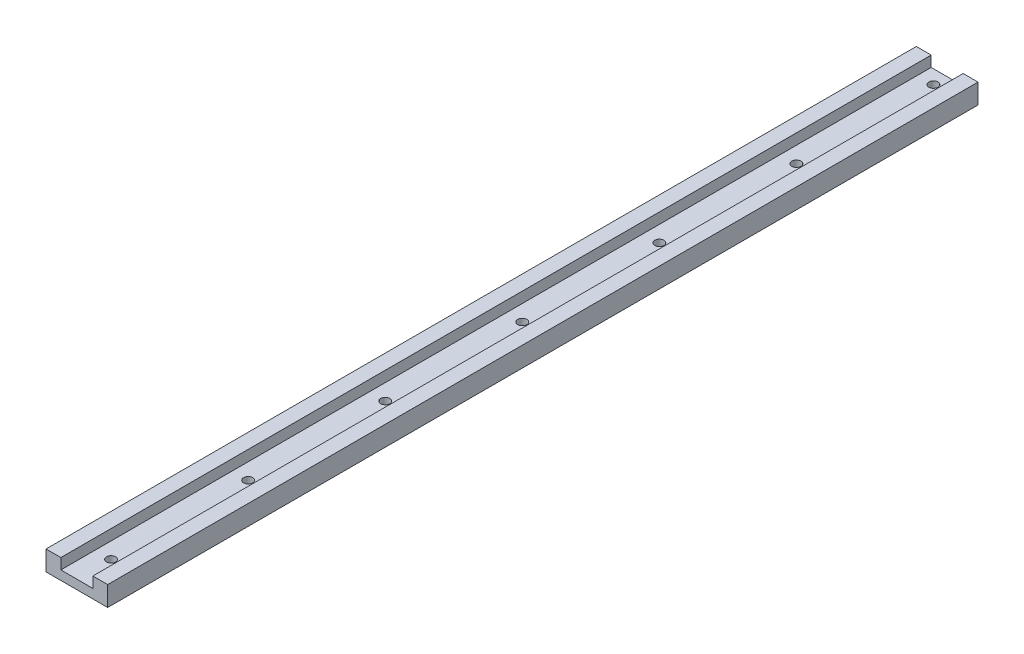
ISO-10303-21;
HEADER;
FILE_DESCRIPTION(('STEP AP214'),'2;1');
FILE_NAME('part.step','',(''),(''),'','','');
FILE_SCHEMA(('AUTOMOTIVE_DESIGN { 1 0 10303 214 1 1 1 1 }'));
ENDSEC;
DATA;
#1=APPLICATION_CONTEXT('core data for automotive mechanical design processes');
#2=APPLICATION_PROTOCOL_DEFINITION('international standard','automotive_design',2000,#1);
#3=PRODUCT_CONTEXT('',#1,'mechanical');
#4=PRODUCT('Part','Part','',(#3));
#5=PRODUCT_RELATED_PRODUCT_CATEGORY('part','',(#4));
#6=PRODUCT_DEFINITION_FORMATION('','',#4);
#7=PRODUCT_DEFINITION_CONTEXT('part definition',#1,'design');
#8=PRODUCT_DEFINITION('design','',#6,#7);
#9=PRODUCT_DEFINITION_SHAPE('','',#8);
#10=(LENGTH_UNIT() NAMED_UNIT(*) SI_UNIT(.MILLI.,.METRE.));
#11=(NAMED_UNIT(*) PLANE_ANGLE_UNIT() SI_UNIT($,.RADIAN.));
#12=(NAMED_UNIT(*) SI_UNIT($,.STERADIAN.) SOLID_ANGLE_UNIT());
#13=UNCERTAINTY_MEASURE_WITH_UNIT(LENGTH_MEASURE(1.E-05),#10,'distance_accuracy_value','');
#14=(GEOMETRIC_REPRESENTATION_CONTEXT(3) GLOBAL_UNCERTAINTY_ASSIGNED_CONTEXT((#13)) GLOBAL_UNIT_ASSIGNED_CONTEXT((#10,
#11,#12)) REPRESENTATION_CONTEXT('',''));
#15=CARTESIAN_POINT('',(0.,0.,0.));
#16=DIRECTION('',(0.,0.,1.));
#17=DIRECTION('',(1.,0.,0.));
#18=AXIS2_PLACEMENT_3D('',#15,#16,#17);
#19=CARTESIAN_POINT('',(13.5,-4.35,381.));
#20=DIRECTION('',(-1.,0.,0.));
#21=DIRECTION('',(0.,-1.,0.));
#22=AXIS2_PLACEMENT_3D('',#19,#20,#21);
#23=PLANE('',#22);
#24=DIRECTION('',(0.,1.,0.));
#25=VECTOR('',#24,1.);
#26=CARTESIAN_POINT('',(13.5,-4.35,0.));
#27=LINE('',#26,#25);
#28=CARTESIAN_POINT('',(13.5,-4.35,0.));
#29=VERTEX_POINT('',#28);
#30=CARTESIAN_POINT('',(13.5,4.35,0.));
#31=VERTEX_POINT('',#30);
#32=EDGE_CURVE('E132',#29,#31,#27,.T.);
#33=ORIENTED_EDGE('',*,*,#32,.T.);
#34=DIRECTION('',(0.,0.,-1.));
#35=VECTOR('',#34,1.);
#36=CARTESIAN_POINT('',(13.5,4.35,381.));
#37=LINE('',#36,#35);
#38=CARTESIAN_POINT('',(13.5,4.35,381.));
#39=VERTEX_POINT('',#38);
#40=EDGE_CURVE('E11',#39,#31,#37,.T.);
#41=ORIENTED_EDGE('',*,*,#40,.F.);
#42=DIRECTION('',(0.,1.,0.));
#43=VECTOR('',#42,1.);
#44=CARTESIAN_POINT('',(13.5,-4.35,381.));
#45=LINE('',#44,#43);
#46=CARTESIAN_POINT('',(13.5,-4.35,381.));
#47=VERTEX_POINT('',#46);
#48=EDGE_CURVE('E147',#47,#39,#45,.T.);
#49=ORIENTED_EDGE('',*,*,#48,.F.);
#50=DIRECTION('',(0.,0.,-1.));
#51=VECTOR('',#50,1.);
#52=CARTESIAN_POINT('',(13.5,-4.35,381.));
#53=LINE('',#52,#51);
#54=EDGE_CURVE('E128',#47,#29,#53,.T.);
#55=ORIENTED_EDGE('',*,*,#54,.T.);
#56=EDGE_LOOP('',(#33,#41,#49,#55));
#57=FACE_BOUND('',#56,.T.);
#58=ADVANCED_FACE('F35',(#57),#23,.F.);
#59=CARTESIAN_POINT('',(7.,4.35,381.));
#60=DIRECTION('',(0.,-1.,0.));
#61=DIRECTION('',(1.,0.,0.));
#62=AXIS2_PLACEMENT_3D('',#59,#60,#61);
#63=PLANE('',#62);
#64=DIRECTION('',(-1.,0.,0.));
#65=VECTOR('',#64,1.);
#66=CARTESIAN_POINT('',(7.,4.35,0.));
#67=LINE('',#66,#65);
#68=CARTESIAN_POINT('',(7.,4.35,0.));
#69=VERTEX_POINT('',#68);
#70=EDGE_CURVE('E135',#31,#69,#67,.T.);
#71=ORIENTED_EDGE('',*,*,#70,.T.);
#72=DIRECTION('',(0.,0.,-1.));
#73=VECTOR('',#72,1.);
#74=CARTESIAN_POINT('',(7.,4.35,381.));
#75=LINE('',#74,#73);
#76=CARTESIAN_POINT('',(7.,4.35,381.));
#77=VERTEX_POINT('',#76);
#78=EDGE_CURVE('E44',#77,#69,#75,.T.);
#79=ORIENTED_EDGE('',*,*,#78,.F.);
#80=DIRECTION('',(-1.,0.,0.));
#81=VECTOR('',#80,1.);
#82=CARTESIAN_POINT('',(7.,4.35,381.));
#83=LINE('',#82,#81);
#84=EDGE_CURVE('E95',#39,#77,#83,.T.);
#85=ORIENTED_EDGE('',*,*,#84,.F.);
#86=ORIENTED_EDGE('',*,*,#40,.T.);
#87=EDGE_LOOP('',(#71,#79,#85,#86));
#88=FACE_BOUND('',#87,.T.);
#89=ADVANCED_FACE('F270',(#88),#63,.F.);
#90=CARTESIAN_POINT('',(7.,4.35,381.));
#91=DIRECTION('',(1.,0.,0.));
#92=DIRECTION('',(0.,1.,0.));
#93=AXIS2_PLACEMENT_3D('',#90,#91,#92);
#94=PLANE('',#93);
#95=DIRECTION('',(0.,-1.,0.));
#96=VECTOR('',#95,1.);
#97=CARTESIAN_POINT('',(7.,4.35,0.));
#98=LINE('',#97,#96);
#99=CARTESIAN_POINT('',(7.,-0.349999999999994,0.));
#100=VERTEX_POINT('',#99);
#101=EDGE_CURVE('E138',#69,#100,#98,.T.);
#102=ORIENTED_EDGE('',*,*,#101,.T.);
#103=DIRECTION('',(0.,0.,-1.));
#104=VECTOR('',#103,1.);
#105=CARTESIAN_POINT('',(7.,-0.349999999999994,381.));
#106=LINE('',#105,#104);
#107=CARTESIAN_POINT('',(7.,-0.349999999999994,381.));
#108=VERTEX_POINT('',#107);
#109=EDGE_CURVE('E157',#108,#100,#106,.T.);
#110=ORIENTED_EDGE('',*,*,#109,.F.);
#111=DIRECTION('',(0.,-1.,0.));
#112=VECTOR('',#111,1.);
#113=CARTESIAN_POINT('',(7.,4.35,381.));
#114=LINE('',#113,#112);
#115=EDGE_CURVE('E167',#77,#108,#114,.T.);
#116=ORIENTED_EDGE('',*,*,#115,.F.);
#117=ORIENTED_EDGE('',*,*,#78,.T.);
#118=EDGE_LOOP('',(#102,#110,#116,#117));
#119=FACE_BOUND('',#118,.T.);
#120=ADVANCED_FACE('F165',(#119),#94,.F.);
#121=CARTESIAN_POINT('',(-7.,-0.349999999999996,381.));
#122=DIRECTION('',(0.,-1.,0.));
#123=DIRECTION('',(1.,0.,0.));
#124=AXIS2_PLACEMENT_3D('',#121,#122,#123);
#125=PLANE('',#124);
#126=CARTESIAN_POINT('',(0.,-0.349999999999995,6.00000000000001));
#127=DIRECTION('',(0.,1.,0.));
#128=DIRECTION('',(-1.,0.,0.));
#129=AXIS2_PLACEMENT_3D('',#126,#127,#128);
#130=CIRCLE('',#129,2.);
#131=CARTESIAN_POINT('',(-2.,-0.349999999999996,6.00000000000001));
#132=VERTEX_POINT('',#131);
#133=EDGE_CURVE('E223',#132,#132,#130,.T.);
#134=ORIENTED_EDGE('',*,*,#133,.F.);
#135=EDGE_LOOP('',(#134));
#136=FACE_BOUND('',#135,.T.);
#137=CARTESIAN_POINT('',(0.,-0.349999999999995,66.));
#138=DIRECTION('',(0.,1.,0.));
#139=DIRECTION('',(-1.,0.,0.));
#140=AXIS2_PLACEMENT_3D('',#137,#138,#139);
#141=CIRCLE('',#140,2.);
#142=CARTESIAN_POINT('',(-2.,-0.349999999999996,66.));
#143=VERTEX_POINT('',#142);
#144=EDGE_CURVE('E215',#143,#143,#141,.T.);
#145=ORIENTED_EDGE('',*,*,#144,.F.);
#146=EDGE_LOOP('',(#145));
#147=FACE_BOUND('',#146,.T.);
#148=CARTESIAN_POINT('',(0.,-0.349999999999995,126.));
#149=DIRECTION('',(0.,1.,0.));
#150=DIRECTION('',(-1.,0.,0.));
#151=AXIS2_PLACEMENT_3D('',#148,#149,#150);
#152=CIRCLE('',#151,2.);
#153=CARTESIAN_POINT('',(-2.,-0.349999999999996,126.));
#154=VERTEX_POINT('',#153);
#155=EDGE_CURVE('E209',#154,#154,#152,.T.);
#156=ORIENTED_EDGE('',*,*,#155,.F.);
#157=EDGE_LOOP('',(#156));
#158=FACE_BOUND('',#157,.T.);
#159=CARTESIAN_POINT('',(0.,-0.349999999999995,186.));
#160=DIRECTION('',(0.,1.,0.));
#161=DIRECTION('',(-1.,0.,0.));
#162=AXIS2_PLACEMENT_3D('',#159,#160,#161);
#163=CIRCLE('',#162,2.);
#164=CARTESIAN_POINT('',(-2.,-0.349999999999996,186.));
#165=VERTEX_POINT('',#164);
#166=EDGE_CURVE('E203',#165,#165,#163,.T.);
#167=ORIENTED_EDGE('',*,*,#166,.F.);
#168=EDGE_LOOP('',(#167));
#169=FACE_BOUND('',#168,.T.);
#170=CARTESIAN_POINT('',(0.,-0.349999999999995,246.));
#171=DIRECTION('',(0.,1.,0.));
#172=DIRECTION('',(-1.,0.,0.));
#173=AXIS2_PLACEMENT_3D('',#170,#171,#172);
#174=CIRCLE('',#173,2.);
#175=CARTESIAN_POINT('',(-2.,-0.349999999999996,246.));
#176=VERTEX_POINT('',#175);
#177=EDGE_CURVE('E197',#176,#176,#174,.T.);
#178=ORIENTED_EDGE('',*,*,#177,.F.);
#179=EDGE_LOOP('',(#178));
#180=FACE_BOUND('',#179,.T.);
#181=CARTESIAN_POINT('',(0.,-0.349999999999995,306.));
#182=DIRECTION('',(0.,1.,0.));
#183=DIRECTION('',(-1.,0.,0.));
#184=AXIS2_PLACEMENT_3D('',#181,#182,#183);
#185=CIRCLE('',#184,2.);
#186=CARTESIAN_POINT('',(-2.,-0.349999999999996,306.));
#187=VERTEX_POINT('',#186);
#188=EDGE_CURVE('E191',#187,#187,#185,.T.);
#189=ORIENTED_EDGE('',*,*,#188,.F.);
#190=EDGE_LOOP('',(#189));
#191=FACE_BOUND('',#190,.T.);
#192=CARTESIAN_POINT('',(0.,-0.349999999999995,366.));
#193=DIRECTION('',(0.,1.,0.));
#194=DIRECTION('',(-1.,0.,0.));
#195=AXIS2_PLACEMENT_3D('',#192,#193,#194);
#196=CIRCLE('',#195,2.);
#197=CARTESIAN_POINT('',(-2.,-0.349999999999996,366.));
#198=VERTEX_POINT('',#197);
#199=EDGE_CURVE('E185',#198,#198,#196,.T.);
#200=ORIENTED_EDGE('',*,*,#199,.F.);
#201=EDGE_LOOP('',(#200));
#202=FACE_BOUND('',#201,.T.);
#203=DIRECTION('',(-1.,0.,0.));
#204=VECTOR('',#203,1.);
#205=CARTESIAN_POINT('',(-7.,-0.349999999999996,0.));
#206=LINE('',#205,#204);
#207=CARTESIAN_POINT('',(-7.,-0.349999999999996,0.));
#208=VERTEX_POINT('',#207);
#209=EDGE_CURVE('E140',#100,#208,#206,.T.);
#210=ORIENTED_EDGE('',*,*,#209,.T.);
#211=DIRECTION('',(0.,0.,-1.));
#212=VECTOR('',#211,1.);
#213=CARTESIAN_POINT('',(-7.,-0.349999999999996,381.));
#214=LINE('',#213,#212);
#215=CARTESIAN_POINT('',(-7.,-0.349999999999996,381.));
#216=VERTEX_POINT('',#215);
#217=EDGE_CURVE('E153',#216,#208,#214,.T.);
#218=ORIENTED_EDGE('',*,*,#217,.F.);
#219=DIRECTION('',(-1.,0.,0.));
#220=VECTOR('',#219,1.);
#221=CARTESIAN_POINT('',(-7.,-0.349999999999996,381.));
#222=LINE('',#221,#220);
#223=EDGE_CURVE('E179',#108,#216,#222,.T.);
#224=ORIENTED_EDGE('',*,*,#223,.F.);
#225=ORIENTED_EDGE('',*,*,#109,.T.);
#226=EDGE_LOOP('',(#210,#218,#224,#225));
#227=FACE_BOUND('',#226,.T.);
#228=ADVANCED_FACE('F175',(#136,#147,#158,#169,#180,#191,#202,#227),#125,.F.);
#229=CARTESIAN_POINT('',(-7.,4.35,381.));
#230=DIRECTION('',(-1.,0.,0.));
#231=DIRECTION('',(0.,-1.,0.));
#232=AXIS2_PLACEMENT_3D('',#229,#230,#231);
#233=PLANE('',#232);
#234=DIRECTION('',(0.,1.,0.));
#235=VECTOR('',#234,1.);
#236=CARTESIAN_POINT('',(-7.,4.35,0.));
#237=LINE('',#236,#235);
#238=CARTESIAN_POINT('',(-7.,4.35,0.));
#239=VERTEX_POINT('',#238);
#240=EDGE_CURVE('E142',#208,#239,#237,.T.);
#241=ORIENTED_EDGE('',*,*,#240,.T.);
#242=DIRECTION('',(0.,0.,-1.));
#243=VECTOR('',#242,1.);
#244=CARTESIAN_POINT('',(-7.,4.35,381.));
#245=LINE('',#244,#243);
#246=CARTESIAN_POINT('',(-7.,4.35,381.));
#247=VERTEX_POINT('',#246);
#248=EDGE_CURVE('E123',#247,#239,#245,.T.);
#249=ORIENTED_EDGE('',*,*,#248,.F.);
#250=DIRECTION('',(0.,1.,0.));
#251=VECTOR('',#250,1.);
#252=CARTESIAN_POINT('',(-7.,4.35,381.));
#253=LINE('',#252,#251);
#254=EDGE_CURVE('E114',#216,#247,#253,.T.);
#255=ORIENTED_EDGE('',*,*,#254,.F.);
#256=ORIENTED_EDGE('',*,*,#217,.T.);
#257=EDGE_LOOP('',(#241,#249,#255,#256));
#258=FACE_BOUND('',#257,.T.);
#259=ADVANCED_FACE('F178',(#258),#233,.F.);
#260=CARTESIAN_POINT('',(-13.5,4.35,381.));
#261=DIRECTION('',(0.,-1.,0.));
#262=DIRECTION('',(0.,0.,-1.));
#263=AXIS2_PLACEMENT_3D('',#260,#261,#262);
#264=PLANE('',#263);
#265=DIRECTION('',(-1.,0.,0.));
#266=VECTOR('',#265,1.);
#267=CARTESIAN_POINT('',(-13.5,4.35,0.));
#268=LINE('',#267,#266);
#269=CARTESIAN_POINT('',(-13.5,4.35,0.));
#270=VERTEX_POINT('',#269);
#271=EDGE_CURVE('E122',#239,#270,#268,.T.);
#272=ORIENTED_EDGE('',*,*,#271,.T.);
#273=DIRECTION('',(0.,0.,-1.));
#274=VECTOR('',#273,1.);
#275=CARTESIAN_POINT('',(-13.5,4.35,381.));
#276=LINE('',#275,#274);
#277=CARTESIAN_POINT('',(-13.5,4.35,381.));
#278=VERTEX_POINT('',#277);
#279=EDGE_CURVE('E119',#278,#270,#276,.T.);
#280=ORIENTED_EDGE('',*,*,#279,.F.);
#281=DIRECTION('',(-1.,0.,0.));
#282=VECTOR('',#281,1.);
#283=CARTESIAN_POINT('',(-13.5,4.35,381.));
#284=LINE('',#283,#282);
#285=EDGE_CURVE('E108',#247,#278,#284,.T.);
#286=ORIENTED_EDGE('',*,*,#285,.F.);
#287=ORIENTED_EDGE('',*,*,#248,.T.);
#288=EDGE_LOOP('',(#272,#280,#286,#287));
#289=FACE_BOUND('',#288,.T.);
#290=ADVANCED_FACE('F120',(#289),#264,.F.);
#291=CARTESIAN_POINT('',(-13.5,-4.35,381.));
#292=DIRECTION('',(1.,0.,0.));
#293=DIRECTION('',(0.,0.,-1.));
#294=AXIS2_PLACEMENT_3D('',#291,#292,#293);
#295=PLANE('',#294);
#296=DIRECTION('',(0.,-1.,0.));
#297=VECTOR('',#296,1.);
#298=CARTESIAN_POINT('',(-13.5,-4.35,0.));
#299=LINE('',#298,#297);
#300=CARTESIAN_POINT('',(-13.5,-4.35,0.));
#301=VERTEX_POINT('',#300);
#302=EDGE_CURVE('E81',#270,#301,#299,.T.);
#303=ORIENTED_EDGE('',*,*,#302,.T.);
#304=DIRECTION('',(0.,0.,-1.));
#305=VECTOR('',#304,1.);
#306=CARTESIAN_POINT('',(-13.5,-4.35,381.));
#307=LINE('',#306,#305);
#308=CARTESIAN_POINT('',(-13.5,-4.35,381.));
#309=VERTEX_POINT('',#308);
#310=EDGE_CURVE('E124',#309,#301,#307,.T.);
#311=ORIENTED_EDGE('',*,*,#310,.F.);
#312=DIRECTION('',(0.,-1.,0.));
#313=VECTOR('',#312,1.);
#314=CARTESIAN_POINT('',(-13.5,-4.35,381.));
#315=LINE('',#314,#313);
#316=EDGE_CURVE('E112',#278,#309,#315,.T.);
#317=ORIENTED_EDGE('',*,*,#316,.F.);
#318=ORIENTED_EDGE('',*,*,#279,.T.);
#319=EDGE_LOOP('',(#303,#311,#317,#318));
#320=FACE_BOUND('',#319,.T.);
#321=ADVANCED_FACE('F126',(#320),#295,.F.);
#322=CARTESIAN_POINT('',(-13.5,-4.35,381.));
#323=DIRECTION('',(0.,1.,0.));
#324=DIRECTION('',(0.,0.,1.));
#325=AXIS2_PLACEMENT_3D('',#322,#323,#324);
#326=PLANE('',#325);
#327=CARTESIAN_POINT('',(0.,-4.35,6.00000000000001));
#328=DIRECTION('',(0.,1.,0.));
#329=DIRECTION('',(-1.,0.,0.));
#330=AXIS2_PLACEMENT_3D('',#327,#328,#329);
#331=CIRCLE('',#330,2.);
#332=CARTESIAN_POINT('',(-2.,-4.35,6.00000000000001));
#333=VERTEX_POINT('',#332);
#334=EDGE_CURVE('E219',#333,#333,#331,.T.);
#335=ORIENTED_EDGE('',*,*,#334,.T.);
#336=EDGE_LOOP('',(#335));
#337=FACE_BOUND('',#336,.T.);
#338=CARTESIAN_POINT('',(0.,-4.35,66.));
#339=DIRECTION('',(0.,1.,0.));
#340=DIRECTION('',(-1.,0.,0.));
#341=AXIS2_PLACEMENT_3D('',#338,#339,#340);
#342=CIRCLE('',#341,2.);
#343=CARTESIAN_POINT('',(-2.,-4.35,66.));
#344=VERTEX_POINT('',#343);
#345=EDGE_CURVE('E212',#344,#344,#342,.T.);
#346=ORIENTED_EDGE('',*,*,#345,.T.);
#347=EDGE_LOOP('',(#346));
#348=FACE_BOUND('',#347,.T.);
#349=CARTESIAN_POINT('',(0.,-4.35,126.));
#350=DIRECTION('',(0.,1.,0.));
#351=DIRECTION('',(-1.,0.,0.));
#352=AXIS2_PLACEMENT_3D('',#349,#350,#351);
#353=CIRCLE('',#352,2.);
#354=CARTESIAN_POINT('',(-2.,-4.35,126.));
#355=VERTEX_POINT('',#354);
#356=EDGE_CURVE('E206',#355,#355,#353,.T.);
#357=ORIENTED_EDGE('',*,*,#356,.T.);
#358=EDGE_LOOP('',(#357));
#359=FACE_BOUND('',#358,.T.);
#360=CARTESIAN_POINT('',(0.,-4.35,186.));
#361=DIRECTION('',(0.,1.,0.));
#362=DIRECTION('',(-1.,0.,0.));
#363=AXIS2_PLACEMENT_3D('',#360,#361,#362);
#364=CIRCLE('',#363,2.);
#365=CARTESIAN_POINT('',(-2.,-4.35,186.));
#366=VERTEX_POINT('',#365);
#367=EDGE_CURVE('E200',#366,#366,#364,.T.);
#368=ORIENTED_EDGE('',*,*,#367,.T.);
#369=EDGE_LOOP('',(#368));
#370=FACE_BOUND('',#369,.T.);
#371=CARTESIAN_POINT('',(0.,-4.35,246.));
#372=DIRECTION('',(0.,1.,0.));
#373=DIRECTION('',(-1.,0.,0.));
#374=AXIS2_PLACEMENT_3D('',#371,#372,#373);
#375=CIRCLE('',#374,2.);
#376=CARTESIAN_POINT('',(-2.,-4.35,246.));
#377=VERTEX_POINT('',#376);
#378=EDGE_CURVE('E194',#377,#377,#375,.T.);
#379=ORIENTED_EDGE('',*,*,#378,.T.);
#380=EDGE_LOOP('',(#379));
#381=FACE_BOUND('',#380,.T.);
#382=CARTESIAN_POINT('',(0.,-4.35,306.));
#383=DIRECTION('',(0.,1.,0.));
#384=DIRECTION('',(-1.,0.,0.));
#385=AXIS2_PLACEMENT_3D('',#382,#383,#384);
#386=CIRCLE('',#385,2.);
#387=CARTESIAN_POINT('',(-2.,-4.35,306.));
#388=VERTEX_POINT('',#387);
#389=EDGE_CURVE('E188',#388,#388,#386,.T.);
#390=ORIENTED_EDGE('',*,*,#389,.T.);
#391=EDGE_LOOP('',(#390));
#392=FACE_BOUND('',#391,.T.);
#393=CARTESIAN_POINT('',(0.,-4.35,366.));
#394=DIRECTION('',(0.,1.,0.));
#395=DIRECTION('',(-1.,0.,0.));
#396=AXIS2_PLACEMENT_3D('',#393,#394,#395);
#397=CIRCLE('',#396,2.);
#398=CARTESIAN_POINT('',(-2.,-4.35,366.));
#399=VERTEX_POINT('',#398);
#400=EDGE_CURVE('E136',#399,#399,#397,.T.);
#401=ORIENTED_EDGE('',*,*,#400,.T.);
#402=EDGE_LOOP('',(#401));
#403=FACE_BOUND('',#402,.T.);
#404=DIRECTION('',(1.,0.,0.));
#405=VECTOR('',#404,1.);
#406=CARTESIAN_POINT('',(-13.5,-4.35,0.));
#407=LINE('',#406,#405);
#408=EDGE_CURVE('E87',#301,#29,#407,.T.);
#409=ORIENTED_EDGE('',*,*,#408,.T.);
#410=ORIENTED_EDGE('',*,*,#54,.F.);
#411=DIRECTION('',(1.,0.,0.));
#412=VECTOR('',#411,1.);
#413=CARTESIAN_POINT('',(-13.5,-4.35,381.));
#414=LINE('',#413,#412);
#415=EDGE_CURVE('E52',#309,#47,#414,.T.);
#416=ORIENTED_EDGE('',*,*,#415,.F.);
#417=ORIENTED_EDGE('',*,*,#310,.T.);
#418=EDGE_LOOP('',(#409,#410,#416,#417));
#419=FACE_BOUND('',#418,.T.);
#420=ADVANCED_FACE('F229',(#337,#348,#359,#370,#381,#392,#403,#419),#326,.F.);
#421=CARTESIAN_POINT('',(0.,0.,381.));
#422=DIRECTION('',(0.,0.,-1.));
#423=DIRECTION('',(-1.,0.,0.));
#424=AXIS2_PLACEMENT_3D('',#421,#422,#423);
#425=PLANE('',#424);
#426=ORIENTED_EDGE('',*,*,#48,.T.);
#427=ORIENTED_EDGE('',*,*,#84,.T.);
#428=ORIENTED_EDGE('',*,*,#115,.T.);
#429=ORIENTED_EDGE('',*,*,#223,.T.);
#430=ORIENTED_EDGE('',*,*,#254,.T.);
#431=ORIENTED_EDGE('',*,*,#285,.T.);
#432=ORIENTED_EDGE('',*,*,#316,.T.);
#433=ORIENTED_EDGE('',*,*,#415,.T.);
#434=EDGE_LOOP('',(#426,#427,#428,#429,#430,#431,#432,#433));
#435=FACE_BOUND('',#434,.T.);
#436=ADVANCED_FACE('F110',(#435),#425,.F.);
#437=CARTESIAN_POINT('',(0.,0.,0.));
#438=DIRECTION('',(0.,0.,-1.));
#439=DIRECTION('',(-1.,0.,0.));
#440=AXIS2_PLACEMENT_3D('',#437,#438,#439);
#441=PLANE('',#440);
#442=ORIENTED_EDGE('',*,*,#32,.F.);
#443=ORIENTED_EDGE('',*,*,#408,.F.);
#444=ORIENTED_EDGE('',*,*,#302,.F.);
#445=ORIENTED_EDGE('',*,*,#271,.F.);
#446=ORIENTED_EDGE('',*,*,#240,.F.);
#447=ORIENTED_EDGE('',*,*,#209,.F.);
#448=ORIENTED_EDGE('',*,*,#101,.F.);
#449=ORIENTED_EDGE('',*,*,#70,.F.);
#450=EDGE_LOOP('',(#442,#443,#444,#445,#446,#447,#448,#449));
#451=FACE_BOUND('',#450,.T.);
#452=ADVANCED_FACE('F171',(#451),#441,.T.);
#453=CARTESIAN_POINT('',(0.,-4.35,366.));
#454=DIRECTION('',(0.,1.,0.));
#455=DIRECTION('',(-1.,0.,0.));
#456=AXIS2_PLACEMENT_3D('',#453,#454,#455);
#457=CYLINDRICAL_SURFACE('',#456,2.);
#458=ORIENTED_EDGE('',*,*,#400,.F.);
#459=EDGE_LOOP('',(#458));
#460=FACE_BOUND('',#459,.T.);
#461=ORIENTED_EDGE('',*,*,#199,.T.);
#462=EDGE_LOOP('',(#461));
#463=FACE_BOUND('',#462,.T.);
#464=ADVANCED_FACE('F254',(#460,#463),#457,.F.);
#465=CARTESIAN_POINT('',(0.,-4.35,306.));
#466=DIRECTION('',(0.,1.,0.));
#467=DIRECTION('',(-1.,0.,0.));
#468=AXIS2_PLACEMENT_3D('',#465,#466,#467);
#469=CYLINDRICAL_SURFACE('',#468,2.);
#470=ORIENTED_EDGE('',*,*,#389,.F.);
#471=EDGE_LOOP('',(#470));
#472=FACE_BOUND('',#471,.T.);
#473=ORIENTED_EDGE('',*,*,#188,.T.);
#474=EDGE_LOOP('',(#473));
#475=FACE_BOUND('',#474,.T.);
#476=ADVANCED_FACE('F256',(#472,#475),#469,.F.);
#477=CARTESIAN_POINT('',(0.,-4.35,246.));
#478=DIRECTION('',(0.,1.,0.));
#479=DIRECTION('',(-1.,0.,0.));
#480=AXIS2_PLACEMENT_3D('',#477,#478,#479);
#481=CYLINDRICAL_SURFACE('',#480,2.);
#482=ORIENTED_EDGE('',*,*,#378,.F.);
#483=EDGE_LOOP('',(#482));
#484=FACE_BOUND('',#483,.T.);
#485=ORIENTED_EDGE('',*,*,#177,.T.);
#486=EDGE_LOOP('',(#485));
#487=FACE_BOUND('',#486,.T.);
#488=ADVANCED_FACE('F263',(#484,#487),#481,.F.);
#489=CARTESIAN_POINT('',(0.,-4.35,186.));
#490=DIRECTION('',(0.,1.,0.));
#491=DIRECTION('',(-1.,0.,0.));
#492=AXIS2_PLACEMENT_3D('',#489,#490,#491);
#493=CYLINDRICAL_SURFACE('',#492,2.);
#494=ORIENTED_EDGE('',*,*,#367,.F.);
#495=EDGE_LOOP('',(#494));
#496=FACE_BOUND('',#495,.T.);
#497=ORIENTED_EDGE('',*,*,#166,.T.);
#498=EDGE_LOOP('',(#497));
#499=FACE_BOUND('',#498,.T.);
#500=ADVANCED_FACE('F342',(#496,#499),#493,.F.);
#501=CARTESIAN_POINT('',(0.,-4.35,126.));
#502=DIRECTION('',(0.,1.,0.));
#503=DIRECTION('',(-1.,0.,0.));
#504=AXIS2_PLACEMENT_3D('',#501,#502,#503);
#505=CYLINDRICAL_SURFACE('',#504,2.);
#506=ORIENTED_EDGE('',*,*,#356,.F.);
#507=EDGE_LOOP('',(#506));
#508=FACE_BOUND('',#507,.T.);
#509=ORIENTED_EDGE('',*,*,#155,.T.);
#510=EDGE_LOOP('',(#509));
#511=FACE_BOUND('',#510,.T.);
#512=ADVANCED_FACE('F351',(#508,#511),#505,.F.);
#513=CARTESIAN_POINT('',(0.,-4.35,66.));
#514=DIRECTION('',(0.,1.,0.));
#515=DIRECTION('',(-1.,0.,0.));
#516=AXIS2_PLACEMENT_3D('',#513,#514,#515);
#517=CYLINDRICAL_SURFACE('',#516,2.);
#518=ORIENTED_EDGE('',*,*,#345,.F.);
#519=EDGE_LOOP('',(#518));
#520=FACE_BOUND('',#519,.T.);
#521=ORIENTED_EDGE('',*,*,#144,.T.);
#522=EDGE_LOOP('',(#521));
#523=FACE_BOUND('',#522,.T.);
#524=ADVANCED_FACE('F235',(#520,#523),#517,.F.);
#525=CARTESIAN_POINT('',(0.,-4.35,6.00000000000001));
#526=DIRECTION('',(0.,1.,0.));
#527=DIRECTION('',(-1.,0.,0.));
#528=AXIS2_PLACEMENT_3D('',#525,#526,#527);
#529=CYLINDRICAL_SURFACE('',#528,2.);
#530=ORIENTED_EDGE('',*,*,#334,.F.);
#531=EDGE_LOOP('',(#530));
#532=FACE_BOUND('',#531,.T.);
#533=ORIENTED_EDGE('',*,*,#133,.T.);
#534=EDGE_LOOP('',(#533));
#535=FACE_BOUND('',#534,.T.);
#536=ADVANCED_FACE('F232',(#532,#535),#529,.F.);
#537=CLOSED_SHELL('',(#58,#89,#120,#228,#259,#290,#321,#420,#436,#452,#464,#476,#488,#500,#512,
#524,#536));
#538=MANIFOLD_SOLID_BREP('B2',#537);
#539=ADVANCED_BREP_SHAPE_REPRESENTATION('',(#18,#538),#14);
#540=SHAPE_DEFINITION_REPRESENTATION(#9,#539);
ENDSEC;
END-ISO-10303-21;
